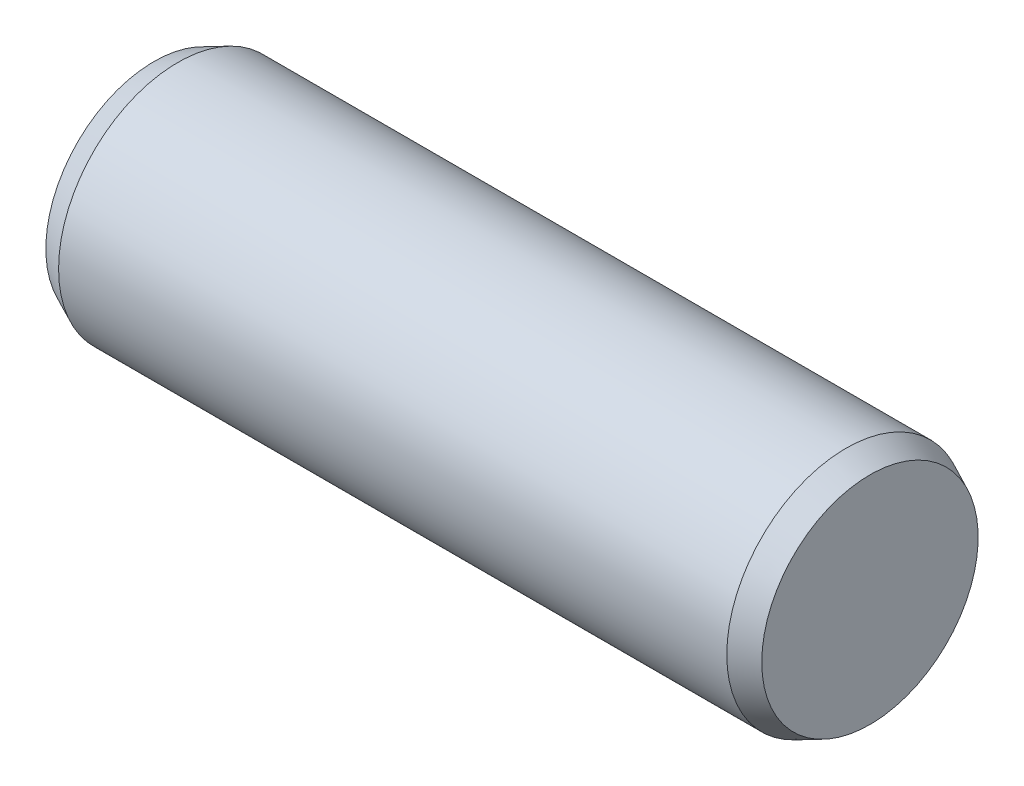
ISO-10303-21;
HEADER;
FILE_DESCRIPTION(('STEP AP214'),'2;1');
FILE_NAME('part.step','',(''),(''),'','','');
FILE_SCHEMA(('AUTOMOTIVE_DESIGN { 1 0 10303 214 1 1 1 1 }'));
ENDSEC;
DATA;
#1=APPLICATION_CONTEXT('core data for automotive mechanical design processes');
#2=APPLICATION_PROTOCOL_DEFINITION('international standard','automotive_design',2000,#1);
#3=PRODUCT_CONTEXT('',#1,'mechanical');
#4=PRODUCT('Part','Part','',(#3));
#5=PRODUCT_RELATED_PRODUCT_CATEGORY('part','',(#4));
#6=PRODUCT_DEFINITION_FORMATION('','',#4);
#7=PRODUCT_DEFINITION_CONTEXT('part definition',#1,'design');
#8=PRODUCT_DEFINITION('design','',#6,#7);
#9=PRODUCT_DEFINITION_SHAPE('','',#8);
#10=(LENGTH_UNIT() NAMED_UNIT(*) SI_UNIT(.MILLI.,.METRE.));
#11=(NAMED_UNIT(*) PLANE_ANGLE_UNIT() SI_UNIT($,.RADIAN.));
#12=(NAMED_UNIT(*) SI_UNIT($,.STERADIAN.) SOLID_ANGLE_UNIT());
#13=UNCERTAINTY_MEASURE_WITH_UNIT(LENGTH_MEASURE(1.E-05),#10,'distance_accuracy_value','');
#14=(GEOMETRIC_REPRESENTATION_CONTEXT(3) GLOBAL_UNCERTAINTY_ASSIGNED_CONTEXT((#13)) GLOBAL_UNIT_ASSIGNED_CONTEXT((#10,
#11,#12)) REPRESENTATION_CONTEXT('',''));
#15=CARTESIAN_POINT('',(0.,0.,0.));
#16=DIRECTION('',(0.,0.,1.));
#17=DIRECTION('',(1.,0.,0.));
#18=AXIS2_PLACEMENT_3D('',#15,#16,#17);
#19=CARTESIAN_POINT('',(0.,0.,0.));
#20=DIRECTION('',(1.,0.,0.));
#21=DIRECTION('',(0.,0.,-1.));
#22=AXIS2_PLACEMENT_3D('',#19,#20,#21);
#23=PLANE('',#22);
#24=CARTESIAN_POINT('',(0.,0.,0.));
#25=DIRECTION('',(1.,0.,0.));
#26=DIRECTION('',(0.,0.,-1.));
#27=AXIS2_PLACEMENT_3D('',#24,#25,#26);
#28=CIRCLE('',#27,4.533692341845);
#29=CARTESIAN_POINT('',(0.,0.,-4.533692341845));
#30=VERTEX_POINT('',#29);
#31=EDGE_CURVE('E10',#30,#30,#28,.F.);
#32=ORIENTED_EDGE('',*,*,#31,.T.);
#33=EDGE_LOOP('',(#32));
#34=FACE_BOUND('',#33,.T.);
#35=ADVANCED_FACE('F34',(#34),#23,.F.);
#36=CARTESIAN_POINT('',(0.,0.,0.));
#37=DIRECTION('',(-1.,0.,0.));
#38=DIRECTION('',(0.,0.,1.));
#39=AXIS2_PLACEMENT_3D('',#36,#37,#38);
#40=CYLINDRICAL_SURFACE('',#39,5.);
#41=CARTESIAN_POINT('',(28.9999999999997,-2.22044604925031E-13,-4.44089209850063E-13));
#42=DIRECTION('',(-1.,0.,0.));
#43=DIRECTION('',(0.,0.,1.));
#44=AXIS2_PLACEMENT_3D('',#41,#42,#43);
#45=CIRCLE('',#44,5.);
#46=CARTESIAN_POINT('',(28.9999999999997,-2.22044604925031E-13,4.99999999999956));
#47=VERTEX_POINT('',#46);
#48=EDGE_CURVE('E45',#47,#47,#45,.T.);
#49=ORIENTED_EDGE('',*,*,#48,.T.);
#50=EDGE_LOOP('',(#49));
#51=FACE_BOUND('',#50,.T.);
#52=CARTESIAN_POINT('',(1.00000000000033,-1.11022302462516E-13,-2.22044604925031E-13));
#53=DIRECTION('',(1.,0.,0.));
#54=DIRECTION('',(0.,0.,-1.));
#55=AXIS2_PLACEMENT_3D('',#52,#53,#54);
#56=CIRCLE('',#55,5.);
#57=CARTESIAN_POINT('',(1.00000000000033,-1.11022302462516E-13,-5.00000000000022));
#58=VERTEX_POINT('',#57);
#59=EDGE_CURVE('E49',#58,#58,#56,.T.);
#60=ORIENTED_EDGE('',*,*,#59,.T.);
#61=EDGE_LOOP('',(#60));
#62=FACE_BOUND('',#61,.T.);
#63=ADVANCED_FACE('F55',(#51,#62),#40,.T.);
#64=CARTESIAN_POINT('',(29.9999999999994,0.,-4.44089209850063E-13));
#65=DIRECTION('',(-1.,0.,0.));
#66=DIRECTION('',(0.,0.,1.));
#67=AXIS2_PLACEMENT_3D('',#64,#65,#66);
#68=PLANE('',#67);
#69=CARTESIAN_POINT('',(29.9999999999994,0.,-4.44089209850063E-13));
#70=DIRECTION('',(-1.,0.,0.));
#71=DIRECTION('',(0.,0.,1.));
#72=AXIS2_PLACEMENT_3D('',#69,#70,#71);
#73=CIRCLE('',#72,4.533692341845);
#74=CARTESIAN_POINT('',(29.9999999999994,0.,4.53369234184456));
#75=VERTEX_POINT('',#74);
#76=EDGE_CURVE('E41',#75,#75,#73,.F.);
#77=ORIENTED_EDGE('',*,*,#76,.T.);
#78=EDGE_LOOP('',(#77));
#79=FACE_BOUND('',#78,.T.);
#80=ADVANCED_FACE('F63',(#79),#68,.F.);
#81=CARTESIAN_POINT('',(28.9999999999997,-2.22044604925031E-13,-4.44089209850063E-13));
#82=DIRECTION('',(-1.,0.,0.));
#83=DIRECTION('',(0.,0.,1.));
#84=AXIS2_PLACEMENT_3D('',#81,#82,#83);
#85=CONICAL_SURFACE('',#84,5.,0.436332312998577);
#86=ORIENTED_EDGE('',*,*,#76,.F.);
#87=EDGE_LOOP('',(#86));
#88=FACE_BOUND('',#87,.T.);
#89=ORIENTED_EDGE('',*,*,#48,.F.);
#90=EDGE_LOOP('',(#89));
#91=FACE_BOUND('',#90,.T.);
#92=ADVANCED_FACE('F59',(#88,#91),#85,.T.);
#93=CARTESIAN_POINT('',(0.,0.,0.));
#94=DIRECTION('',(1.,0.,0.));
#95=DIRECTION('',(0.,0.,-1.));
#96=AXIS2_PLACEMENT_3D('',#93,#94,#95);
#97=CONICAL_SURFACE('',#96,4.533692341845,0.436332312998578);
#98=ORIENTED_EDGE('',*,*,#59,.F.);
#99=EDGE_LOOP('',(#98));
#100=FACE_BOUND('',#99,.T.);
#101=ORIENTED_EDGE('',*,*,#31,.F.);
#102=EDGE_LOOP('',(#101));
#103=FACE_BOUND('',#102,.T.);
#104=ADVANCED_FACE('F36',(#100,#103),#97,.T.);
#105=CLOSED_SHELL('',(#35,#63,#80,#92,#104));
#106=MANIFOLD_SOLID_BREP('B2',#105);
#107=ADVANCED_BREP_SHAPE_REPRESENTATION('',(#18,#106),#14);
#108=SHAPE_DEFINITION_REPRESENTATION(#9,#107);
ENDSEC;
END-ISO-10303-21;
